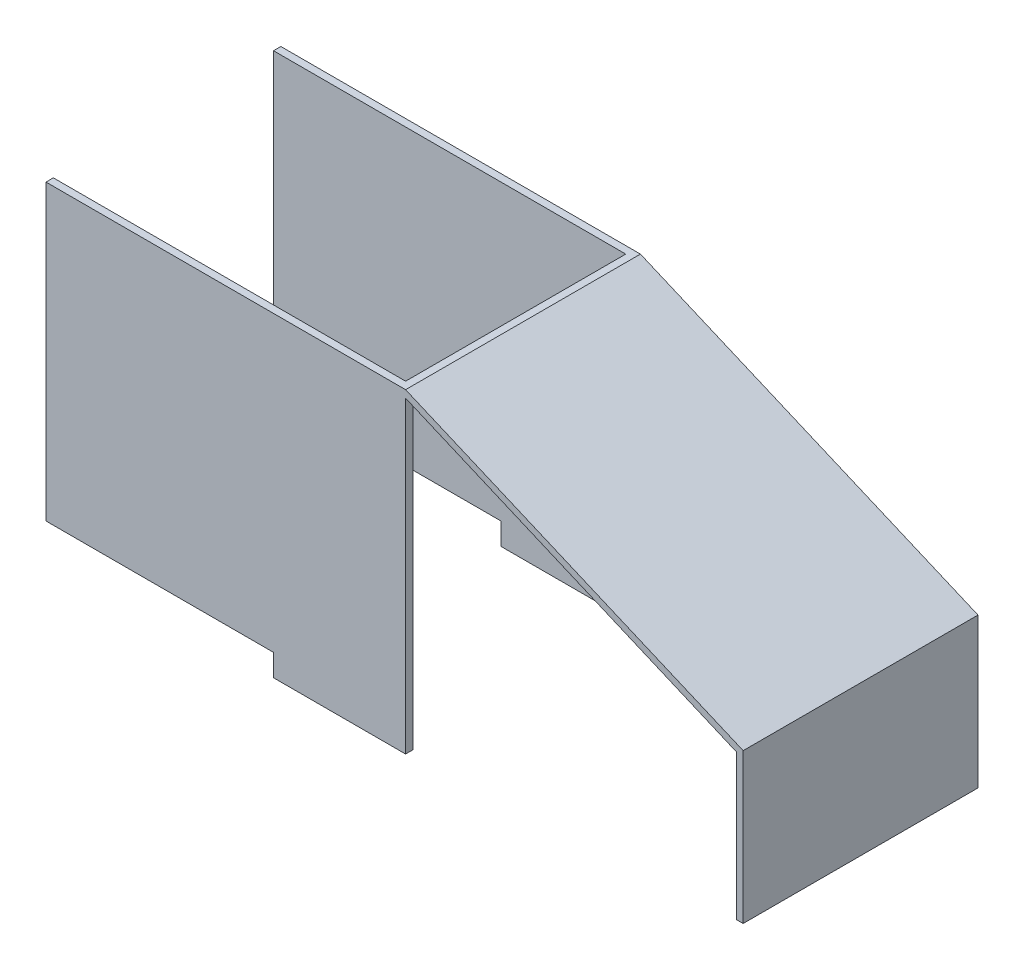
ISO-10303-21;
HEADER;
FILE_DESCRIPTION(('STEP AP214'),'2;1');
FILE_NAME('part.step','',(''),(''),'','','');
FILE_SCHEMA(('AUTOMOTIVE_DESIGN { 1 0 10303 214 1 1 1 1 }'));
ENDSEC;
DATA;
#1=APPLICATION_CONTEXT('core data for automotive mechanical design processes');
#2=APPLICATION_PROTOCOL_DEFINITION('international standard','automotive_design',2000,#1);
#3=PRODUCT_CONTEXT('',#1,'mechanical');
#4=PRODUCT('Part','Part','',(#3));
#5=PRODUCT_RELATED_PRODUCT_CATEGORY('part','',(#4));
#6=PRODUCT_DEFINITION_FORMATION('','',#4);
#7=PRODUCT_DEFINITION_CONTEXT('part definition',#1,'design');
#8=PRODUCT_DEFINITION('design','',#6,#7);
#9=PRODUCT_DEFINITION_SHAPE('','',#8);
#10=(LENGTH_UNIT() NAMED_UNIT(*) SI_UNIT(.MILLI.,.METRE.));
#11=(NAMED_UNIT(*) PLANE_ANGLE_UNIT() SI_UNIT($,.RADIAN.));
#12=(NAMED_UNIT(*) SI_UNIT($,.STERADIAN.) SOLID_ANGLE_UNIT());
#13=UNCERTAINTY_MEASURE_WITH_UNIT(LENGTH_MEASURE(1.E-05),#10,'distance_accuracy_value','');
#14=(GEOMETRIC_REPRESENTATION_CONTEXT(3) GLOBAL_UNCERTAINTY_ASSIGNED_CONTEXT((#13)) GLOBAL_UNIT_ASSIGNED_CONTEXT((#10,
#11,#12)) REPRESENTATION_CONTEXT('',''));
#15=CARTESIAN_POINT('',(0.,0.,0.));
#16=DIRECTION('',(0.,0.,1.));
#17=DIRECTION('',(1.,0.,0.));
#18=AXIS2_PLACEMENT_3D('',#15,#16,#17);
#19=CARTESIAN_POINT('',(12.5,20.,-8.));
#20=DIRECTION('',(-1.,0.,0.));
#21=DIRECTION('',(0.,0.,1.));
#22=AXIS2_PLACEMENT_3D('',#19,#20,#21);
#23=PLANE('',#22);
#24=DIRECTION('',(0.,-1.,0.));
#25=VECTOR('',#24,1.);
#26=CARTESIAN_POINT('',(12.5,19.5,-7.5));
#27=LINE('',#26,#25);
#28=CARTESIAN_POINT('',(12.5,19.5,-7.5));
#29=VERTEX_POINT('',#28);
#30=CARTESIAN_POINT('',(12.5,-1.5,-7.5));
#31=VERTEX_POINT('',#30);
#32=EDGE_CURVE('E181',#29,#31,#27,.T.);
#33=ORIENTED_EDGE('',*,*,#32,.T.);
#34=DIRECTION('',(0.,0.,1.));
#35=VECTOR('',#34,1.);
#36=CARTESIAN_POINT('',(12.5,-1.5,8.));
#37=LINE('',#36,#35);
#38=CARTESIAN_POINT('',(12.5,-1.5,-8.));
#39=VERTEX_POINT('',#38);
#40=EDGE_CURVE('E168',#39,#31,#37,.T.);
#41=ORIENTED_EDGE('',*,*,#40,.F.);
#42=DIRECTION('',(0.,-1.,0.));
#43=VECTOR('',#42,1.);
#44=CARTESIAN_POINT('',(12.5,20.,-8.));
#45=LINE('',#44,#43);
#46=CARTESIAN_POINT('',(12.5,19.5,-8.));
#47=VERTEX_POINT('',#46);
#48=EDGE_CURVE('E179',#47,#39,#45,.T.);
#49=ORIENTED_EDGE('',*,*,#48,.F.);
#50=DIRECTION('',(0.,0.,1.));
#51=VECTOR('',#50,1.);
#52=CARTESIAN_POINT('',(12.5,19.5,-38.4795013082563));
#53=LINE('',#52,#51);
#54=EDGE_CURVE('E289',#47,#29,#53,.T.);
#55=ORIENTED_EDGE('',*,*,#54,.T.);
#56=EDGE_LOOP('',(#33,#41,#49,#55));
#57=FACE_BOUND('',#56,.T.);
#58=ADVANCED_FACE('F33',(#57),#23,.F.);
#59=DIRECTION('',(0.,-1.,0.));
#60=VECTOR('',#59,1.);
#61=CARTESIAN_POINT('',(12.5,20.,8.));
#62=LINE('',#61,#60);
#63=CARTESIAN_POINT('',(12.5,19.5,8.));
#64=VERTEX_POINT('',#63);
#65=CARTESIAN_POINT('',(12.5,-1.5,8.));
#66=VERTEX_POINT('',#65);
#67=EDGE_CURVE('E199',#64,#66,#62,.T.);
#68=ORIENTED_EDGE('',*,*,#67,.T.);
#69=CARTESIAN_POINT('',(12.5,-1.5,7.5));
#70=VERTEX_POINT('',#69);
#71=EDGE_CURVE('E51',#70,#66,#37,.T.);
#72=ORIENTED_EDGE('',*,*,#71,.F.);
#73=DIRECTION('',(0.,-1.,0.));
#74=VECTOR('',#73,1.);
#75=CARTESIAN_POINT('',(12.5,19.5,7.5));
#76=LINE('',#75,#74);
#77=CARTESIAN_POINT('',(12.5,19.5,7.5));
#78=VERTEX_POINT('',#77);
#79=EDGE_CURVE('E286',#78,#70,#76,.T.);
#80=ORIENTED_EDGE('',*,*,#79,.F.);
#81=EDGE_CURVE('E11',#78,#64,#53,.T.);
#82=ORIENTED_EDGE('',*,*,#81,.T.);
#83=EDGE_LOOP('',(#68,#72,#80,#82));
#84=FACE_BOUND('',#83,.T.);
#85=ADVANCED_FACE('F35',(#84),#23,.F.);
#86=CARTESIAN_POINT('',(12.,20.,-7.5));
#87=DIRECTION('',(1.,0.,0.));
#88=DIRECTION('',(0.,0.,-1.));
#89=AXIS2_PLACEMENT_3D('',#86,#87,#88);
#90=PLANE('',#89);
#91=DIRECTION('',(0.,0.,-1.));
#92=VECTOR('',#91,1.);
#93=CARTESIAN_POINT('',(12.,19.5,-7.5));
#94=LINE('',#93,#92);
#95=CARTESIAN_POINT('',(12.,19.5,7.5));
#96=VERTEX_POINT('',#95);
#97=CARTESIAN_POINT('',(12.,19.5,-7.5));
#98=VERTEX_POINT('',#97);
#99=EDGE_CURVE('E285',#96,#98,#94,.T.);
#100=ORIENTED_EDGE('',*,*,#99,.F.);
#101=DIRECTION('',(0.,-1.,0.));
#102=VECTOR('',#101,1.);
#103=CARTESIAN_POINT('',(12.,20.,7.5));
#104=LINE('',#103,#102);
#105=CARTESIAN_POINT('',(12.,20.,7.5));
#106=VERTEX_POINT('',#105);
#107=EDGE_CURVE('E223',#106,#96,#104,.T.);
#108=ORIENTED_EDGE('',*,*,#107,.F.);
#109=DIRECTION('',(0.,0.,1.));
#110=VECTOR('',#109,1.);
#111=CARTESIAN_POINT('',(12.,20.,-7.5));
#112=LINE('',#111,#110);
#113=CARTESIAN_POINT('',(12.,20.,-7.5));
#114=VERTEX_POINT('',#113);
#115=EDGE_CURVE('E260',#114,#106,#112,.T.);
#116=ORIENTED_EDGE('',*,*,#115,.F.);
#117=DIRECTION('',(0.,-1.,0.));
#118=VECTOR('',#117,1.);
#119=CARTESIAN_POINT('',(12.,20.,-7.5));
#120=LINE('',#119,#118);
#121=EDGE_CURVE('E226',#114,#98,#120,.T.);
#122=ORIENTED_EDGE('',*,*,#121,.T.);
#123=EDGE_LOOP('',(#100,#108,#116,#122));
#124=FACE_BOUND('',#123,.T.);
#125=ADVANCED_FACE('F409',(#124),#90,.F.);
#126=CARTESIAN_POINT('',(3.5,0.,-21.4536240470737));
#127=DIRECTION('',(-1.,0.,0.));
#128=DIRECTION('',(0.,-1.,0.));
#129=AXIS2_PLACEMENT_3D('',#126,#127,#128);
#130=PLANE('',#129);
#131=DIRECTION('',(0.,0.,1.));
#132=VECTOR('',#131,1.);
#133=CARTESIAN_POINT('',(3.5,-1.5,8.00000000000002));
#134=LINE('',#133,#132);
#135=CARTESIAN_POINT('',(3.5,-1.5,7.5));
#136=VERTEX_POINT('',#135);
#137=CARTESIAN_POINT('',(3.5,-1.5,8.00000000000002));
#138=VERTEX_POINT('',#137);
#139=EDGE_CURVE('E173',#136,#138,#134,.T.);
#140=ORIENTED_EDGE('',*,*,#139,.T.);
#141=DIRECTION('',(0.,-1.,0.));
#142=VECTOR('',#141,1.);
#143=CARTESIAN_POINT('',(3.5,0.,8.));
#144=LINE('',#143,#142);
#145=CARTESIAN_POINT('',(3.5,0.,8.));
#146=VERTEX_POINT('',#145);
#147=EDGE_CURVE('E274',#146,#138,#144,.T.);
#148=ORIENTED_EDGE('',*,*,#147,.F.);
#149=DIRECTION('',(0.,0.,1.));
#150=VECTOR('',#149,1.);
#151=CARTESIAN_POINT('',(3.5,0.,-21.4536240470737));
#152=LINE('',#151,#150);
#153=CARTESIAN_POINT('',(3.5,0.,7.5));
#154=VERTEX_POINT('',#153);
#155=EDGE_CURVE('E43',#154,#146,#152,.T.);
#156=ORIENTED_EDGE('',*,*,#155,.F.);
#157=DIRECTION('',(0.,1.,0.));
#158=VECTOR('',#157,1.);
#159=CARTESIAN_POINT('',(3.5,0.,7.5));
#160=LINE('',#159,#158);
#161=EDGE_CURVE('E270',#136,#154,#160,.T.);
#162=ORIENTED_EDGE('',*,*,#161,.F.);
#163=EDGE_LOOP('',(#140,#148,#156,#162));
#164=FACE_BOUND('',#163,.T.);
#165=ADVANCED_FACE('F401',(#164),#130,.T.);
#166=CARTESIAN_POINT('',(0.,0.,0.));
#167=DIRECTION('',(0.,1.,0.));
#168=DIRECTION('',(0.,0.,1.));
#169=AXIS2_PLACEMENT_3D('',#166,#167,#168);
#170=PLANE('',#169);
#171=DIRECTION('',(-1.,0.,0.));
#172=VECTOR('',#171,1.);
#173=CARTESIAN_POINT('',(-12.,0.,-8.));
#174=LINE('',#173,#172);
#175=CARTESIAN_POINT('',(3.5,0.,-8.));
#176=VERTEX_POINT('',#175);
#177=CARTESIAN_POINT('',(-12.,0.,-8.));
#178=VERTEX_POINT('',#177);
#179=EDGE_CURVE('E210',#176,#178,#174,.T.);
#180=ORIENTED_EDGE('',*,*,#179,.F.);
#181=CARTESIAN_POINT('',(3.5,0.,-7.5));
#182=VERTEX_POINT('',#181);
#183=EDGE_CURVE('E197',#176,#182,#152,.T.);
#184=ORIENTED_EDGE('',*,*,#183,.T.);
#185=DIRECTION('',(1.,0.,0.));
#186=VECTOR('',#185,1.);
#187=CARTESIAN_POINT('',(-12.,0.,-7.5));
#188=LINE('',#187,#186);
#189=CARTESIAN_POINT('',(-12.,0.,-7.5));
#190=VERTEX_POINT('',#189);
#191=EDGE_CURVE('E236',#190,#182,#188,.T.);
#192=ORIENTED_EDGE('',*,*,#191,.F.);
#193=DIRECTION('',(0.,0.,1.));
#194=VECTOR('',#193,1.);
#195=CARTESIAN_POINT('',(-12.,0.,-8.));
#196=LINE('',#195,#194);
#197=EDGE_CURVE('E246',#178,#190,#196,.T.);
#198=ORIENTED_EDGE('',*,*,#197,.F.);
#199=EDGE_LOOP('',(#180,#184,#192,#198));
#200=FACE_BOUND('',#199,.T.);
#201=ADVANCED_FACE('F245',(#200),#170,.F.);
#202=CARTESIAN_POINT('',(-12.,20.,-8.));
#203=DIRECTION('',(0.,0.,1.));
#204=DIRECTION('',(1.,0.,0.));
#205=AXIS2_PLACEMENT_3D('',#202,#203,#204);
#206=PLANE('',#205);
#207=ORIENTED_EDGE('',*,*,#48,.T.);
#208=DIRECTION('',(1.,0.,0.));
#209=VECTOR('',#208,1.);
#210=CARTESIAN_POINT('',(-14.6176709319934,-1.5,-7.99999999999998));
#211=LINE('',#210,#209);
#212=CARTESIAN_POINT('',(3.5,-1.5,-7.99999999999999));
#213=VERTEX_POINT('',#212);
#214=EDGE_CURVE('E165',#213,#39,#211,.T.);
#215=ORIENTED_EDGE('',*,*,#214,.F.);
#216=DIRECTION('',(0.,1.,0.));
#217=VECTOR('',#216,1.);
#218=CARTESIAN_POINT('',(3.5,0.,-8.));
#219=LINE('',#218,#217);
#220=EDGE_CURVE('E37',#213,#176,#219,.T.);
#221=ORIENTED_EDGE('',*,*,#220,.T.);
#222=ORIENTED_EDGE('',*,*,#179,.T.);
#223=DIRECTION('',(0.,-1.,0.));
#224=VECTOR('',#223,1.);
#225=CARTESIAN_POINT('',(-12.,20.,-8.));
#226=LINE('',#225,#224);
#227=CARTESIAN_POINT('',(-12.,20.,-8.));
#228=VERTEX_POINT('',#227);
#229=EDGE_CURVE('E187',#228,#178,#226,.T.);
#230=ORIENTED_EDGE('',*,*,#229,.F.);
#231=DIRECTION('',(-1.,0.,0.));
#232=VECTOR('',#231,1.);
#233=CARTESIAN_POINT('',(-12.,20.,-8.));
#234=LINE('',#233,#232);
#235=CARTESIAN_POINT('',(12.5,20.,-8.));
#236=VERTEX_POINT('',#235);
#237=EDGE_CURVE('E265',#236,#228,#234,.T.);
#238=ORIENTED_EDGE('',*,*,#237,.F.);
#239=DIRECTION('',(0.92,-0.391918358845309,0.));
#240=VECTOR('',#239,1.);
#241=CARTESIAN_POINT('',(12.5,20.,-8.));
#242=LINE('',#241,#240);
#243=CARTESIAN_POINT('',(35.5,10.2020410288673,-8.));
#244=VERTEX_POINT('',#243);
#245=EDGE_CURVE('E325',#236,#244,#242,.T.);
#246=ORIENTED_EDGE('',*,*,#245,.T.);
#247=DIRECTION('',(0.,-1.,0.));
#248=VECTOR('',#247,1.);
#249=CARTESIAN_POINT('',(35.5,10.2020410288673,-8.));
#250=LINE('',#249,#248);
#251=CARTESIAN_POINT('',(35.5,0.,-8.));
#252=VERTEX_POINT('',#251);
#253=EDGE_CURVE('E327',#244,#252,#250,.T.);
#254=ORIENTED_EDGE('',*,*,#253,.T.);
#255=DIRECTION('',(-1.,0.,0.));
#256=VECTOR('',#255,1.);
#257=CARTESIAN_POINT('',(35.04,0.,-8.));
#258=LINE('',#257,#256);
#259=CARTESIAN_POINT('',(35.04,0.,-8.));
#260=VERTEX_POINT('',#259);
#261=EDGE_CURVE('E331',#252,#260,#258,.T.);
#262=ORIENTED_EDGE('',*,*,#261,.T.);
#263=DIRECTION('',(0.,1.,0.));
#264=VECTOR('',#263,1.);
#265=CARTESIAN_POINT('',(35.04,9.89800020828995,-8.));
#266=LINE('',#265,#264);
#267=CARTESIAN_POINT('',(35.04,9.89800020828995,-8.));
#268=VERTEX_POINT('',#267);
#269=EDGE_CURVE('E347',#260,#268,#266,.T.);
#270=ORIENTED_EDGE('',*,*,#269,.T.);
#271=DIRECTION('',(-0.92,0.391918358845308,0.));
#272=VECTOR('',#271,1.);
#273=CARTESIAN_POINT('',(12.5,19.5,-8.));
#274=LINE('',#273,#272);
#275=EDGE_CURVE('E185',#268,#47,#274,.T.);
#276=ORIENTED_EDGE('',*,*,#275,.T.);
#277=EDGE_LOOP('',(#207,#215,#221,#222,#230,#238,#246,#254,#262,#270,#276));
#278=FACE_BOUND('',#277,.T.);
#279=ADVANCED_FACE('F183',(#278),#206,.F.);
#280=CARTESIAN_POINT('',(-12.,20.,-8.));
#281=DIRECTION('',(1.,0.,0.));
#282=DIRECTION('',(0.,0.,-1.));
#283=AXIS2_PLACEMENT_3D('',#280,#281,#282);
#284=PLANE('',#283);
#285=ORIENTED_EDGE('',*,*,#197,.T.);
#286=DIRECTION('',(0.,-1.,0.));
#287=VECTOR('',#286,1.);
#288=CARTESIAN_POINT('',(-12.,20.,-7.5));
#289=LINE('',#288,#287);
#290=CARTESIAN_POINT('',(-12.,20.,-7.5));
#291=VERTEX_POINT('',#290);
#292=EDGE_CURVE('E192',#291,#190,#289,.T.);
#293=ORIENTED_EDGE('',*,*,#292,.F.);
#294=DIRECTION('',(0.,0.,1.));
#295=VECTOR('',#294,1.);
#296=CARTESIAN_POINT('',(-12.,20.,-8.));
#297=LINE('',#296,#295);
#298=EDGE_CURVE('E263',#228,#291,#297,.T.);
#299=ORIENTED_EDGE('',*,*,#298,.F.);
#300=ORIENTED_EDGE('',*,*,#229,.T.);
#301=EDGE_LOOP('',(#285,#293,#299,#300));
#302=FACE_BOUND('',#301,.T.);
#303=ADVANCED_FACE('F406',(#302),#284,.F.);
#304=CARTESIAN_POINT('',(-12.,20.,-7.5));
#305=DIRECTION('',(0.,0.,-1.));
#306=DIRECTION('',(-1.,0.,0.));
#307=AXIS2_PLACEMENT_3D('',#304,#305,#306);
#308=PLANE('',#307);
#309=DIRECTION('',(0.,-1.,0.));
#310=VECTOR('',#309,1.);
#311=CARTESIAN_POINT('',(3.5,0.,-7.5));
#312=LINE('',#311,#310);
#313=CARTESIAN_POINT('',(3.5,-1.5,-7.5));
#314=VERTEX_POINT('',#313);
#315=EDGE_CURVE('E280',#182,#314,#312,.T.);
#316=ORIENTED_EDGE('',*,*,#315,.T.);
#317=DIRECTION('',(1.,0.,0.));
#318=VECTOR('',#317,1.);
#319=CARTESIAN_POINT('',(-12.,-1.5,-7.5));
#320=LINE('',#319,#318);
#321=EDGE_CURVE('E59',#314,#31,#320,.T.);
#322=ORIENTED_EDGE('',*,*,#321,.T.);
#323=ORIENTED_EDGE('',*,*,#32,.F.);
#324=DIRECTION('',(1.,0.,0.));
#325=VECTOR('',#324,1.);
#326=CARTESIAN_POINT('',(-29.5945614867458,19.5,-7.49999999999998));
#327=LINE('',#326,#325);
#328=EDGE_CURVE('E317',#98,#29,#327,.T.);
#329=ORIENTED_EDGE('',*,*,#328,.F.);
#330=ORIENTED_EDGE('',*,*,#121,.F.);
#331=DIRECTION('',(1.,0.,0.));
#332=VECTOR('',#331,1.);
#333=CARTESIAN_POINT('',(-12.,20.,-7.5));
#334=LINE('',#333,#332);
#335=EDGE_CURVE('E238',#291,#114,#334,.T.);
#336=ORIENTED_EDGE('',*,*,#335,.F.);
#337=ORIENTED_EDGE('',*,*,#292,.T.);
#338=ORIENTED_EDGE('',*,*,#191,.T.);
#339=EDGE_LOOP('',(#316,#322,#323,#329,#330,#336,#337,#338));
#340=FACE_BOUND('',#339,.T.);
#341=ADVANCED_FACE('F235',(#340),#308,.F.);
#342=CARTESIAN_POINT('',(-12.,20.,7.5));
#343=DIRECTION('',(0.,0.,1.));
#344=DIRECTION('',(1.,0.,0.));
#345=AXIS2_PLACEMENT_3D('',#342,#343,#344);
#346=PLANE('',#345);
#347=ORIENTED_EDGE('',*,*,#79,.T.);
#348=DIRECTION('',(-1.,0.,0.));
#349=VECTOR('',#348,1.);
#350=CARTESIAN_POINT('',(-12.,-1.5,7.5));
#351=LINE('',#350,#349);
#352=EDGE_CURVE('E373',#70,#136,#351,.T.);
#353=ORIENTED_EDGE('',*,*,#352,.T.);
#354=ORIENTED_EDGE('',*,*,#161,.T.);
#355=DIRECTION('',(-1.,0.,0.));
#356=VECTOR('',#355,1.);
#357=CARTESIAN_POINT('',(-12.,0.,7.5));
#358=LINE('',#357,#356);
#359=CARTESIAN_POINT('',(-12.,0.,7.5));
#360=VERTEX_POINT('',#359);
#361=EDGE_CURVE('E248',#154,#360,#358,.T.);
#362=ORIENTED_EDGE('',*,*,#361,.T.);
#363=DIRECTION('',(0.,-1.,0.));
#364=VECTOR('',#363,1.);
#365=CARTESIAN_POINT('',(-12.,20.,7.5));
#366=LINE('',#365,#364);
#367=CARTESIAN_POINT('',(-12.,20.,7.5));
#368=VERTEX_POINT('',#367);
#369=EDGE_CURVE('E220',#368,#360,#366,.T.);
#370=ORIENTED_EDGE('',*,*,#369,.F.);
#371=DIRECTION('',(-1.,0.,0.));
#372=VECTOR('',#371,1.);
#373=CARTESIAN_POINT('',(-12.,20.,7.5));
#374=LINE('',#373,#372);
#375=EDGE_CURVE('E258',#106,#368,#374,.T.);
#376=ORIENTED_EDGE('',*,*,#375,.F.);
#377=ORIENTED_EDGE('',*,*,#107,.T.);
#378=DIRECTION('',(1.,0.,0.));
#379=VECTOR('',#378,1.);
#380=CARTESIAN_POINT('',(-29.5945614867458,19.5,7.50000000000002));
#381=LINE('',#380,#379);
#382=EDGE_CURVE('E304',#96,#78,#381,.T.);
#383=ORIENTED_EDGE('',*,*,#382,.T.);
#384=EDGE_LOOP('',(#347,#353,#354,#362,#370,#376,#377,#383));
#385=FACE_BOUND('',#384,.T.);
#386=ADVANCED_FACE('F366',(#385),#346,.F.);
#387=CARTESIAN_POINT('',(-12.,20.,7.5));
#388=DIRECTION('',(1.,0.,0.));
#389=DIRECTION('',(0.,0.,-1.));
#390=AXIS2_PLACEMENT_3D('',#387,#388,#389);
#391=PLANE('',#390);
#392=DIRECTION('',(0.,0.,1.));
#393=VECTOR('',#392,1.);
#394=CARTESIAN_POINT('',(-12.,0.,7.5));
#395=LINE('',#394,#393);
#396=CARTESIAN_POINT('',(-12.,0.,8.));
#397=VERTEX_POINT('',#396);
#398=EDGE_CURVE('E209',#360,#397,#395,.T.);
#399=ORIENTED_EDGE('',*,*,#398,.T.);
#400=DIRECTION('',(0.,-1.,0.));
#401=VECTOR('',#400,1.);
#402=CARTESIAN_POINT('',(-12.,20.,8.));
#403=LINE('',#402,#401);
#404=CARTESIAN_POINT('',(-12.,20.,8.));
#405=VERTEX_POINT('',#404);
#406=EDGE_CURVE('E217',#405,#397,#403,.T.);
#407=ORIENTED_EDGE('',*,*,#406,.F.);
#408=DIRECTION('',(0.,0.,1.));
#409=VECTOR('',#408,1.);
#410=CARTESIAN_POINT('',(-12.,20.,7.5));
#411=LINE('',#410,#409);
#412=EDGE_CURVE('E256',#368,#405,#411,.T.);
#413=ORIENTED_EDGE('',*,*,#412,.F.);
#414=ORIENTED_EDGE('',*,*,#369,.T.);
#415=EDGE_LOOP('',(#399,#407,#413,#414));
#416=FACE_BOUND('',#415,.T.);
#417=ADVANCED_FACE('F411',(#416),#391,.F.);
#418=CARTESIAN_POINT('',(-12.,20.,8.));
#419=DIRECTION('',(0.,0.,-1.));
#420=DIRECTION('',(-1.,0.,0.));
#421=AXIS2_PLACEMENT_3D('',#418,#419,#420);
#422=PLANE('',#421);
#423=ORIENTED_EDGE('',*,*,#147,.T.);
#424=DIRECTION('',(1.,0.,0.));
#425=VECTOR('',#424,1.);
#426=CARTESIAN_POINT('',(-14.6176709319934,-1.5,8.00000000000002));
#427=LINE('',#426,#425);
#428=EDGE_CURVE('E362',#138,#66,#427,.T.);
#429=ORIENTED_EDGE('',*,*,#428,.T.);
#430=ORIENTED_EDGE('',*,*,#67,.F.);
#431=DIRECTION('',(0.92,-0.391918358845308,0.));
#432=VECTOR('',#431,1.);
#433=CARTESIAN_POINT('',(12.5,19.5,8.));
#434=LINE('',#433,#432);
#435=CARTESIAN_POINT('',(35.04,9.89800020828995,8.));
#436=VERTEX_POINT('',#435);
#437=EDGE_CURVE('E298',#64,#436,#434,.T.);
#438=ORIENTED_EDGE('',*,*,#437,.T.);
#439=DIRECTION('',(0.,-1.,0.));
#440=VECTOR('',#439,1.);
#441=CARTESIAN_POINT('',(35.04,9.89800020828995,8.));
#442=LINE('',#441,#440);
#443=CARTESIAN_POINT('',(35.04,0.,8.));
#444=VERTEX_POINT('',#443);
#445=EDGE_CURVE('E301',#436,#444,#442,.T.);
#446=ORIENTED_EDGE('',*,*,#445,.T.);
#447=DIRECTION('',(1.,0.,0.));
#448=VECTOR('',#447,1.);
#449=CARTESIAN_POINT('',(35.04,0.,8.));
#450=LINE('',#449,#448);
#451=CARTESIAN_POINT('',(35.5,0.,8.));
#452=VERTEX_POINT('',#451);
#453=EDGE_CURVE('E337',#444,#452,#450,.T.);
#454=ORIENTED_EDGE('',*,*,#453,.T.);
#455=DIRECTION('',(0.,1.,0.));
#456=VECTOR('',#455,1.);
#457=CARTESIAN_POINT('',(35.5,10.2020410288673,8.));
#458=LINE('',#457,#456);
#459=CARTESIAN_POINT('',(35.5,10.2020410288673,8.));
#460=VERTEX_POINT('',#459);
#461=EDGE_CURVE('E340',#452,#460,#458,.T.);
#462=ORIENTED_EDGE('',*,*,#461,.T.);
#463=DIRECTION('',(-0.92,0.391918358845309,0.));
#464=VECTOR('',#463,1.);
#465=CARTESIAN_POINT('',(12.5,20.,8.));
#466=LINE('',#465,#464);
#467=CARTESIAN_POINT('',(12.5,20.,8.));
#468=VERTEX_POINT('',#467);
#469=EDGE_CURVE('E292',#460,#468,#466,.T.);
#470=ORIENTED_EDGE('',*,*,#469,.T.);
#471=DIRECTION('',(1.,0.,0.));
#472=VECTOR('',#471,1.);
#473=CARTESIAN_POINT('',(-12.,20.,8.));
#474=LINE('',#473,#472);
#475=EDGE_CURVE('E253',#405,#468,#474,.T.);
#476=ORIENTED_EDGE('',*,*,#475,.F.);
#477=ORIENTED_EDGE('',*,*,#406,.T.);
#478=DIRECTION('',(1.,0.,0.));
#479=VECTOR('',#478,1.);
#480=CARTESIAN_POINT('',(-12.,0.,8.));
#481=LINE('',#480,#479);
#482=EDGE_CURVE('E204',#397,#146,#481,.T.);
#483=ORIENTED_EDGE('',*,*,#482,.T.);
#484=EDGE_LOOP('',(#423,#429,#430,#438,#446,#454,#462,#470,#476,#477,#483));
#485=FACE_BOUND('',#484,.T.);
#486=ADVANCED_FACE('F360',(#485),#422,.F.);
#487=CARTESIAN_POINT('',(0.,20.,0.));
#488=DIRECTION('',(0.,1.,0.));
#489=DIRECTION('',(0.,0.,1.));
#490=AXIS2_PLACEMENT_3D('',#487,#488,#489);
#491=PLANE('',#490);
#492=DIRECTION('',(0.,0.,-1.));
#493=VECTOR('',#492,1.);
#494=CARTESIAN_POINT('',(12.5,20.,-8.));
#495=LINE('',#494,#493);
#496=EDGE_CURVE('E208',#468,#236,#495,.T.);
#497=ORIENTED_EDGE('',*,*,#496,.T.);
#498=ORIENTED_EDGE('',*,*,#237,.T.);
#499=ORIENTED_EDGE('',*,*,#298,.T.);
#500=ORIENTED_EDGE('',*,*,#335,.T.);
#501=ORIENTED_EDGE('',*,*,#115,.T.);
#502=ORIENTED_EDGE('',*,*,#375,.T.);
#503=ORIENTED_EDGE('',*,*,#412,.T.);
#504=ORIENTED_EDGE('',*,*,#475,.T.);
#505=EDGE_LOOP('',(#497,#498,#499,#500,#501,#502,#503,#504));
#506=FACE_BOUND('',#505,.T.);
#507=ADVANCED_FACE('F389',(#506),#491,.T.);
#508=ORIENTED_EDGE('',*,*,#361,.F.);
#509=ORIENTED_EDGE('',*,*,#155,.T.);
#510=ORIENTED_EDGE('',*,*,#482,.F.);
#511=ORIENTED_EDGE('',*,*,#398,.F.);
#512=EDGE_LOOP('',(#508,#509,#510,#511));
#513=FACE_BOUND('',#512,.T.);
#514=ADVANCED_FACE('F398',(#513),#170,.F.);
#515=EDGE_CURVE('E169',#213,#314,#134,.T.);
#516=ORIENTED_EDGE('',*,*,#515,.T.);
#517=ORIENTED_EDGE('',*,*,#315,.F.);
#518=ORIENTED_EDGE('',*,*,#183,.F.);
#519=ORIENTED_EDGE('',*,*,#220,.F.);
#520=EDGE_LOOP('',(#516,#517,#518,#519));
#521=FACE_BOUND('',#520,.T.);
#522=ADVANCED_FACE('F405',(#521),#130,.T.);
#523=CARTESIAN_POINT('',(-29.5945614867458,19.5,7.50000000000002));
#524=DIRECTION('',(0.,-1.,0.));
#525=DIRECTION('',(0.,0.,-1.));
#526=AXIS2_PLACEMENT_3D('',#523,#524,#525);
#527=PLANE('',#526);
#528=ORIENTED_EDGE('',*,*,#99,.T.);
#529=ORIENTED_EDGE('',*,*,#328,.T.);
#530=DIRECTION('',(0.,0.,-1.));
#531=VECTOR('',#530,1.);
#532=CARTESIAN_POINT('',(12.5,19.5,7.5));
#533=LINE('',#532,#531);
#534=EDGE_CURVE('E307',#78,#29,#533,.T.);
#535=ORIENTED_EDGE('',*,*,#534,.F.);
#536=ORIENTED_EDGE('',*,*,#382,.F.);
#537=EDGE_LOOP('',(#528,#529,#535,#536));
#538=FACE_BOUND('',#537,.T.);
#539=ADVANCED_FACE('F371',(#538),#527,.T.);
#540=CARTESIAN_POINT('',(12.5,20.,-38.4795013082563));
#541=DIRECTION('',(0.391918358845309,0.92,0.));
#542=DIRECTION('',(-0.92,0.391918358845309,0.));
#543=AXIS2_PLACEMENT_3D('',#540,#541,#542);
#544=PLANE('',#543);
#545=ORIENTED_EDGE('',*,*,#245,.F.);
#546=ORIENTED_EDGE('',*,*,#496,.F.);
#547=ORIENTED_EDGE('',*,*,#469,.F.);
#548=DIRECTION('',(0.,0.,1.));
#549=VECTOR('',#548,1.);
#550=CARTESIAN_POINT('',(35.5,10.2020410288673,-38.4795013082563));
#551=LINE('',#550,#549);
#552=EDGE_CURVE('E345',#244,#460,#551,.T.);
#553=ORIENTED_EDGE('',*,*,#552,.F.);
#554=EDGE_LOOP('',(#545,#546,#547,#553));
#555=FACE_BOUND('',#554,.T.);
#556=ADVANCED_FACE('F387',(#555),#544,.T.);
#557=CARTESIAN_POINT('',(35.5,10.2020410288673,-38.4795013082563));
#558=DIRECTION('',(1.,0.,0.));
#559=DIRECTION('',(0.,0.,-1.));
#560=AXIS2_PLACEMENT_3D('',#557,#558,#559);
#561=PLANE('',#560);
#562=ORIENTED_EDGE('',*,*,#253,.F.);
#563=ORIENTED_EDGE('',*,*,#552,.T.);
#564=ORIENTED_EDGE('',*,*,#461,.F.);
#565=DIRECTION('',(0.,0.,1.));
#566=VECTOR('',#565,1.);
#567=CARTESIAN_POINT('',(35.5,0.,-38.4795013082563));
#568=LINE('',#567,#566);
#569=EDGE_CURVE('E348',#252,#452,#568,.T.);
#570=ORIENTED_EDGE('',*,*,#569,.F.);
#571=EDGE_LOOP('',(#562,#563,#564,#570));
#572=FACE_BOUND('',#571,.T.);
#573=ADVANCED_FACE('F460',(#572),#561,.T.);
#574=CARTESIAN_POINT('',(35.04,0.,-38.4795013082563));
#575=DIRECTION('',(0.,-1.,0.));
#576=DIRECTION('',(1.,0.,0.));
#577=AXIS2_PLACEMENT_3D('',#574,#575,#576);
#578=PLANE('',#577);
#579=ORIENTED_EDGE('',*,*,#261,.F.);
#580=ORIENTED_EDGE('',*,*,#569,.T.);
#581=ORIENTED_EDGE('',*,*,#453,.F.);
#582=DIRECTION('',(0.,0.,1.));
#583=VECTOR('',#582,1.);
#584=CARTESIAN_POINT('',(35.04,0.,-38.4795013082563));
#585=LINE('',#584,#583);
#586=EDGE_CURVE('E349',#260,#444,#585,.T.);
#587=ORIENTED_EDGE('',*,*,#586,.F.);
#588=EDGE_LOOP('',(#579,#580,#581,#587));
#589=FACE_BOUND('',#588,.T.);
#590=ADVANCED_FACE('F380',(#589),#578,.T.);
#591=CARTESIAN_POINT('',(35.04,9.89800020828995,-38.4795013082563));
#592=DIRECTION('',(-1.,0.,0.));
#593=DIRECTION('',(0.,0.,1.));
#594=AXIS2_PLACEMENT_3D('',#591,#592,#593);
#595=PLANE('',#594);
#596=ORIENTED_EDGE('',*,*,#269,.F.);
#597=ORIENTED_EDGE('',*,*,#586,.T.);
#598=ORIENTED_EDGE('',*,*,#445,.F.);
#599=DIRECTION('',(0.,0.,1.));
#600=VECTOR('',#599,1.);
#601=CARTESIAN_POINT('',(35.04,9.89800020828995,-38.4795013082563));
#602=LINE('',#601,#600);
#603=EDGE_CURVE('E291',#268,#436,#602,.T.);
#604=ORIENTED_EDGE('',*,*,#603,.F.);
#605=EDGE_LOOP('',(#596,#597,#598,#604));
#606=FACE_BOUND('',#605,.T.);
#607=ADVANCED_FACE('F358',(#606),#595,.T.);
#608=CARTESIAN_POINT('',(12.5,19.5,-38.4795013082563));
#609=DIRECTION('',(-0.391918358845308,-0.92,0.));
#610=DIRECTION('',(0.92,-0.391918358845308,0.));
#611=AXIS2_PLACEMENT_3D('',#608,#609,#610);
#612=PLANE('',#611);
#613=ORIENTED_EDGE('',*,*,#275,.F.);
#614=ORIENTED_EDGE('',*,*,#603,.T.);
#615=ORIENTED_EDGE('',*,*,#437,.F.);
#616=ORIENTED_EDGE('',*,*,#81,.F.);
#617=ORIENTED_EDGE('',*,*,#534,.T.);
#618=ORIENTED_EDGE('',*,*,#54,.F.);
#619=EDGE_LOOP('',(#613,#614,#615,#616,#617,#618));
#620=FACE_BOUND('',#619,.T.);
#621=ADVANCED_FACE('F357',(#620),#612,.T.);
#622=CARTESIAN_POINT('',(-14.6176709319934,-1.5,8.00000000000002));
#623=DIRECTION('',(0.,1.,0.));
#624=DIRECTION('',(0.,0.,1.));
#625=AXIS2_PLACEMENT_3D('',#622,#623,#624);
#626=PLANE('',#625);
#627=ORIENTED_EDGE('',*,*,#515,.F.);
#628=ORIENTED_EDGE('',*,*,#214,.T.);
#629=ORIENTED_EDGE('',*,*,#40,.T.);
#630=ORIENTED_EDGE('',*,*,#321,.F.);
#631=EDGE_LOOP('',(#627,#628,#629,#630));
#632=FACE_BOUND('',#631,.T.);
#633=ADVANCED_FACE('F167',(#632),#626,.F.);
#634=ORIENTED_EDGE('',*,*,#71,.T.);
#635=ORIENTED_EDGE('',*,*,#428,.F.);
#636=ORIENTED_EDGE('',*,*,#139,.F.);
#637=ORIENTED_EDGE('',*,*,#352,.F.);
#638=EDGE_LOOP('',(#634,#635,#636,#637));
#639=FACE_BOUND('',#638,.T.);
#640=ADVANCED_FACE('F466',(#639),#626,.F.);
#641=CLOSED_SHELL('',(#58,#85,#125,#165,#201,#279,#303,#341,#386,#417,#486,#507,#514,#522,#539,
#556,#573,#590,#607,#621,#633,#640));
#642=MANIFOLD_SOLID_BREP('B2',#641);
#643=ADVANCED_BREP_SHAPE_REPRESENTATION('',(#18,#642),#14);
#644=SHAPE_DEFINITION_REPRESENTATION(#9,#643);
ENDSEC;
END-ISO-10303-21;
